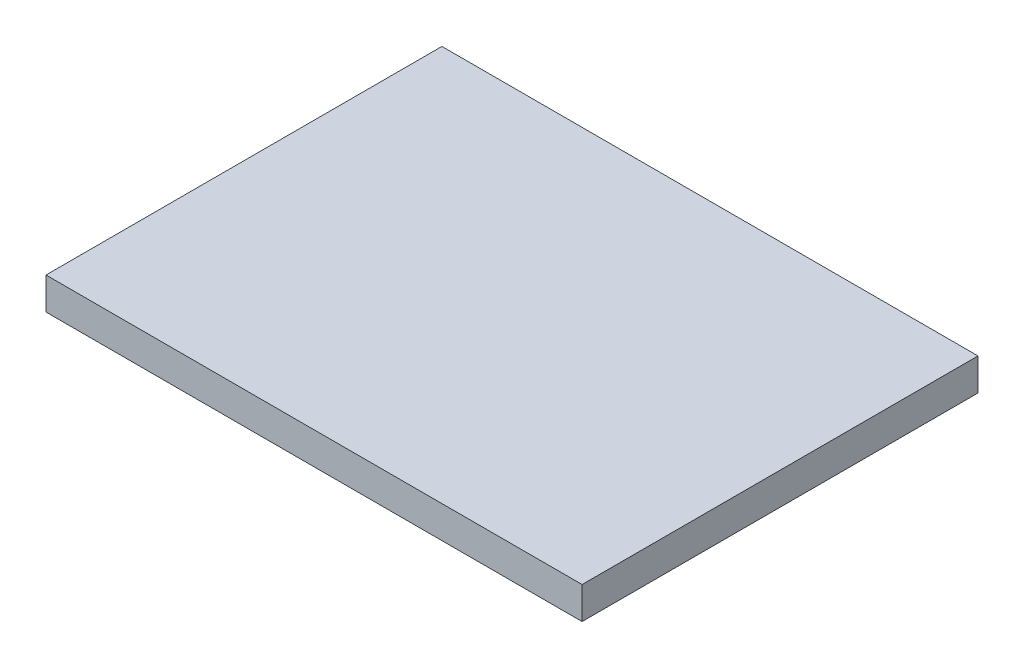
ISO-10303-21;
HEADER;
FILE_DESCRIPTION(('STEP AP214'),'2;1');
FILE_NAME('part.step','',(''),(''),'','','');
FILE_SCHEMA(('AUTOMOTIVE_DESIGN { 1 0 10303 214 1 1 1 1 }'));
ENDSEC;
DATA;
#1=APPLICATION_CONTEXT('core data for automotive mechanical design processes');
#2=APPLICATION_PROTOCOL_DEFINITION('international standard','automotive_design',2000,#1);
#3=PRODUCT_CONTEXT('',#1,'mechanical');
#4=PRODUCT('Part','Part','',(#3));
#5=PRODUCT_RELATED_PRODUCT_CATEGORY('part','',(#4));
#6=PRODUCT_DEFINITION_FORMATION('','',#4);
#7=PRODUCT_DEFINITION_CONTEXT('part definition',#1,'design');
#8=PRODUCT_DEFINITION('design','',#6,#7);
#9=PRODUCT_DEFINITION_SHAPE('','',#8);
#10=(LENGTH_UNIT() NAMED_UNIT(*) SI_UNIT(.MILLI.,.METRE.));
#11=(NAMED_UNIT(*) PLANE_ANGLE_UNIT() SI_UNIT($,.RADIAN.));
#12=(NAMED_UNIT(*) SI_UNIT($,.STERADIAN.) SOLID_ANGLE_UNIT());
#13=UNCERTAINTY_MEASURE_WITH_UNIT(LENGTH_MEASURE(1.E-05),#10,'distance_accuracy_value','');
#14=(GEOMETRIC_REPRESENTATION_CONTEXT(3) GLOBAL_UNCERTAINTY_ASSIGNED_CONTEXT((#13)) GLOBAL_UNIT_ASSIGNED_CONTEXT((#10,
#11,#12)) REPRESENTATION_CONTEXT('',''));
#15=CARTESIAN_POINT('',(0.,0.,0.));
#16=DIRECTION('',(0.,0.,1.));
#17=DIRECTION('',(1.,0.,0.));
#18=AXIS2_PLACEMENT_3D('',#15,#16,#17);
#19=CARTESIAN_POINT('',(125.25,15.,92.5));
#20=DIRECTION('',(-1.,0.,0.));
#21=DIRECTION('',(0.,0.,1.));
#22=AXIS2_PLACEMENT_3D('',#19,#20,#21);
#23=PLANE('',#22);
#24=DIRECTION('',(0.,0.,-1.));
#25=VECTOR('',#24,1.);
#26=CARTESIAN_POINT('',(125.25,0.,92.5));
#27=LINE('',#26,#25);
#28=CARTESIAN_POINT('',(125.25,0.,92.5));
#29=VERTEX_POINT('',#28);
#30=CARTESIAN_POINT('',(125.25,0.,-92.5));
#31=VERTEX_POINT('',#30);
#32=EDGE_CURVE('E96',#29,#31,#27,.T.);
#33=ORIENTED_EDGE('',*,*,#32,.T.);
#34=DIRECTION('',(0.,-1.,0.));
#35=VECTOR('',#34,1.);
#36=CARTESIAN_POINT('',(125.25,15.,-92.5));
#37=LINE('',#36,#35);
#38=CARTESIAN_POINT('',(125.25,15.,-92.5));
#39=VERTEX_POINT('',#38);
#40=EDGE_CURVE('E11',#39,#31,#37,.T.);
#41=ORIENTED_EDGE('',*,*,#40,.F.);
#42=DIRECTION('',(0.,0.,-1.));
#43=VECTOR('',#42,1.);
#44=CARTESIAN_POINT('',(125.25,15.,92.5));
#45=LINE('',#44,#43);
#46=CARTESIAN_POINT('',(125.25,15.,92.5));
#47=VERTEX_POINT('',#46);
#48=EDGE_CURVE('E84',#47,#39,#45,.T.);
#49=ORIENTED_EDGE('',*,*,#48,.F.);
#50=DIRECTION('',(0.,-1.,0.));
#51=VECTOR('',#50,1.);
#52=CARTESIAN_POINT('',(125.25,15.,92.5));
#53=LINE('',#52,#51);
#54=EDGE_CURVE('E92',#47,#29,#53,.T.);
#55=ORIENTED_EDGE('',*,*,#54,.T.);
#56=EDGE_LOOP('',(#33,#41,#49,#55));
#57=FACE_BOUND('',#56,.T.);
#58=ADVANCED_FACE('F33',(#57),#23,.F.);
#59=CARTESIAN_POINT('',(-125.25,15.,-92.5));
#60=DIRECTION('',(0.,0.,1.));
#61=DIRECTION('',(1.,0.,0.));
#62=AXIS2_PLACEMENT_3D('',#59,#60,#61);
#63=PLANE('',#62);
#64=DIRECTION('',(-1.,0.,0.));
#65=VECTOR('',#64,1.);
#66=CARTESIAN_POINT('',(-125.25,0.,-92.5));
#67=LINE('',#66,#65);
#68=CARTESIAN_POINT('',(-125.25,0.,-92.5));
#69=VERTEX_POINT('',#68);
#70=EDGE_CURVE('E88',#31,#69,#67,.T.);
#71=ORIENTED_EDGE('',*,*,#70,.T.);
#72=DIRECTION('',(0.,-1.,0.));
#73=VECTOR('',#72,1.);
#74=CARTESIAN_POINT('',(-125.25,15.,-92.5));
#75=LINE('',#74,#73);
#76=CARTESIAN_POINT('',(-125.25,15.,-92.5));
#77=VERTEX_POINT('',#76);
#78=EDGE_CURVE('E41',#77,#69,#75,.T.);
#79=ORIENTED_EDGE('',*,*,#78,.F.);
#80=DIRECTION('',(-1.,0.,0.));
#81=VECTOR('',#80,1.);
#82=CARTESIAN_POINT('',(-125.25,15.,-92.5));
#83=LINE('',#82,#81);
#84=EDGE_CURVE('E79',#39,#77,#83,.T.);
#85=ORIENTED_EDGE('',*,*,#84,.F.);
#86=ORIENTED_EDGE('',*,*,#40,.T.);
#87=EDGE_LOOP('',(#71,#79,#85,#86));
#88=FACE_BOUND('',#87,.T.);
#89=ADVANCED_FACE('F87',(#88),#63,.F.);
#90=CARTESIAN_POINT('',(-125.25,15.,92.5));
#91=DIRECTION('',(1.,0.,0.));
#92=DIRECTION('',(0.,0.,-1.));
#93=AXIS2_PLACEMENT_3D('',#90,#91,#92);
#94=PLANE('',#93);
#95=DIRECTION('',(0.,0.,1.));
#96=VECTOR('',#95,1.);
#97=CARTESIAN_POINT('',(-125.25,0.,92.5));
#98=LINE('',#97,#96);
#99=CARTESIAN_POINT('',(-125.25,0.,92.5));
#100=VERTEX_POINT('',#99);
#101=EDGE_CURVE('E66',#69,#100,#98,.T.);
#102=ORIENTED_EDGE('',*,*,#101,.T.);
#103=DIRECTION('',(0.,-1.,0.));
#104=VECTOR('',#103,1.);
#105=CARTESIAN_POINT('',(-125.25,15.,92.5));
#106=LINE('',#105,#104);
#107=CARTESIAN_POINT('',(-125.25,15.,92.5));
#108=VERTEX_POINT('',#107);
#109=EDGE_CURVE('E89',#108,#100,#106,.T.);
#110=ORIENTED_EDGE('',*,*,#109,.F.);
#111=DIRECTION('',(0.,0.,1.));
#112=VECTOR('',#111,1.);
#113=CARTESIAN_POINT('',(-125.25,15.,92.5));
#114=LINE('',#113,#112);
#115=EDGE_CURVE('E82',#77,#108,#114,.T.);
#116=ORIENTED_EDGE('',*,*,#115,.F.);
#117=ORIENTED_EDGE('',*,*,#78,.T.);
#118=EDGE_LOOP('',(#102,#110,#116,#117));
#119=FACE_BOUND('',#118,.T.);
#120=ADVANCED_FACE('F90',(#119),#94,.F.);
#121=CARTESIAN_POINT('',(-125.25,15.,92.5));
#122=DIRECTION('',(0.,0.,-1.));
#123=DIRECTION('',(-1.,0.,0.));
#124=AXIS2_PLACEMENT_3D('',#121,#122,#123);
#125=PLANE('',#124);
#126=DIRECTION('',(1.,0.,0.));
#127=VECTOR('',#126,1.);
#128=CARTESIAN_POINT('',(-125.25,0.,92.5));
#129=LINE('',#128,#127);
#130=EDGE_CURVE('E72',#100,#29,#129,.T.);
#131=ORIENTED_EDGE('',*,*,#130,.T.);
#132=ORIENTED_EDGE('',*,*,#54,.F.);
#133=DIRECTION('',(1.,0.,0.));
#134=VECTOR('',#133,1.);
#135=CARTESIAN_POINT('',(-125.25,15.,92.5));
#136=LINE('',#135,#134);
#137=EDGE_CURVE('E49',#108,#47,#136,.T.);
#138=ORIENTED_EDGE('',*,*,#137,.F.);
#139=ORIENTED_EDGE('',*,*,#109,.T.);
#140=EDGE_LOOP('',(#131,#132,#138,#139));
#141=FACE_BOUND('',#140,.T.);
#142=ADVANCED_FACE('F103',(#141),#125,.F.);
#143=CARTESIAN_POINT('',(0.,15.,0.));
#144=DIRECTION('',(0.,-1.,0.));
#145=DIRECTION('',(0.,0.,-1.));
#146=AXIS2_PLACEMENT_3D('',#143,#144,#145);
#147=PLANE('',#146);
#148=ORIENTED_EDGE('',*,*,#48,.T.);
#149=ORIENTED_EDGE('',*,*,#84,.T.);
#150=ORIENTED_EDGE('',*,*,#115,.T.);
#151=ORIENTED_EDGE('',*,*,#137,.T.);
#152=EDGE_LOOP('',(#148,#149,#150,#151));
#153=FACE_BOUND('',#152,.T.);
#154=ADVANCED_FACE('F80',(#153),#147,.F.);
#155=CARTESIAN_POINT('',(0.,0.,0.));
#156=DIRECTION('',(0.,-1.,0.));
#157=DIRECTION('',(0.,0.,-1.));
#158=AXIS2_PLACEMENT_3D('',#155,#156,#157);
#159=PLANE('',#158);
#160=ORIENTED_EDGE('',*,*,#32,.F.);
#161=ORIENTED_EDGE('',*,*,#130,.F.);
#162=ORIENTED_EDGE('',*,*,#101,.F.);
#163=ORIENTED_EDGE('',*,*,#70,.F.);
#164=EDGE_LOOP('',(#160,#161,#162,#163));
#165=FACE_BOUND('',#164,.T.);
#166=ADVANCED_FACE('F106',(#165),#159,.T.);
#167=CLOSED_SHELL('',(#58,#89,#120,#142,#154,#166));
#168=MANIFOLD_SOLID_BREP('B2',#167);
#169=ADVANCED_BREP_SHAPE_REPRESENTATION('',(#18,#168),#14);
#170=SHAPE_DEFINITION_REPRESENTATION(#9,#169);
ENDSEC;
END-ISO-10303-21;
